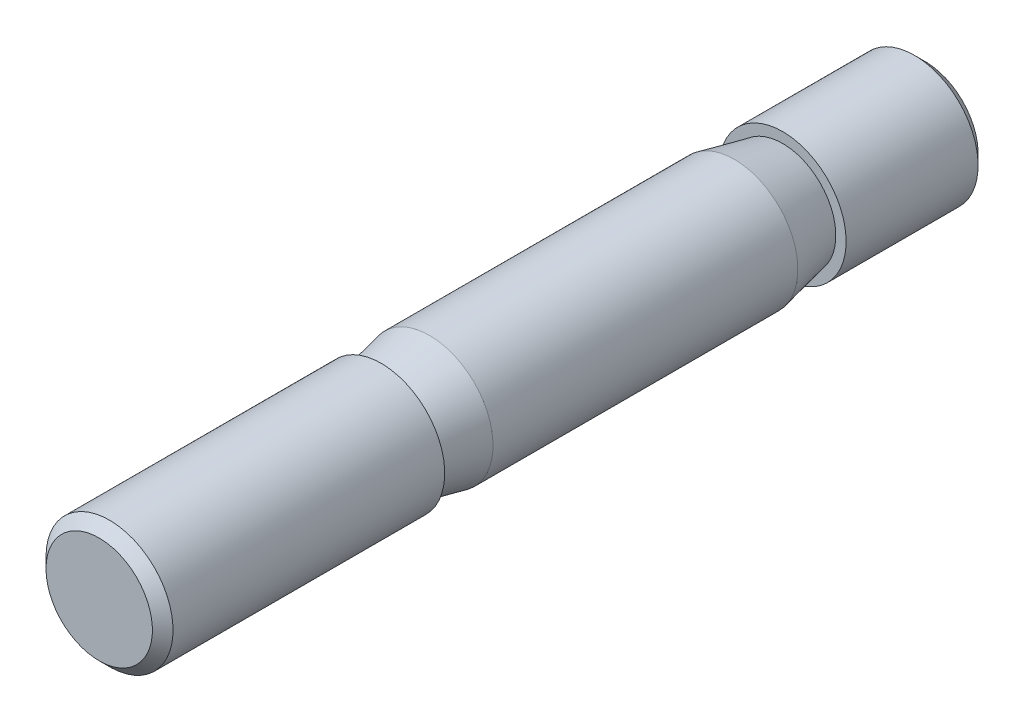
ISO-10303-21;
HEADER;
FILE_DESCRIPTION(('STEP AP214'),'2;1');
FILE_NAME('part.step','',(''),(''),'','','');
FILE_SCHEMA(('AUTOMOTIVE_DESIGN { 1 0 10303 214 1 1 1 1 }'));
ENDSEC;
DATA;
#1=APPLICATION_CONTEXT('core data for automotive mechanical design processes');
#2=APPLICATION_PROTOCOL_DEFINITION('international standard','automotive_design',2000,#1);
#3=PRODUCT_CONTEXT('',#1,'mechanical');
#4=PRODUCT('Part','Part','',(#3));
#5=PRODUCT_RELATED_PRODUCT_CATEGORY('part','',(#4));
#6=PRODUCT_DEFINITION_FORMATION('','',#4);
#7=PRODUCT_DEFINITION_CONTEXT('part definition',#1,'design');
#8=PRODUCT_DEFINITION('design','',#6,#7);
#9=PRODUCT_DEFINITION_SHAPE('','',#8);
#10=(LENGTH_UNIT() NAMED_UNIT(*) SI_UNIT(.MILLI.,.METRE.));
#11=(NAMED_UNIT(*) PLANE_ANGLE_UNIT() SI_UNIT($,.RADIAN.));
#12=(NAMED_UNIT(*) SI_UNIT($,.STERADIAN.) SOLID_ANGLE_UNIT());
#13=UNCERTAINTY_MEASURE_WITH_UNIT(LENGTH_MEASURE(1.E-05),#10,'distance_accuracy_value','');
#14=(GEOMETRIC_REPRESENTATION_CONTEXT(3) GLOBAL_UNCERTAINTY_ASSIGNED_CONTEXT((#13)) GLOBAL_UNIT_ASSIGNED_CONTEXT((#10,
#11,#12)) REPRESENTATION_CONTEXT('',''));
#15=CARTESIAN_POINT('',(0.,0.,0.));
#16=DIRECTION('',(0.,0.,1.));
#17=DIRECTION('',(1.,0.,0.));
#18=AXIS2_PLACEMENT_3D('',#15,#16,#17);
#19=CARTESIAN_POINT('',(0.,0.,50.));
#20=DIRECTION('',(0.,0.,-1.));
#21=DIRECTION('',(-1.,0.,0.));
#22=AXIS2_PLACEMENT_3D('',#19,#20,#21);
#23=PLANE('',#22);
#24=CARTESIAN_POINT('',(0.,0.,50.));
#25=DIRECTION('',(0.,0.,-1.));
#26=DIRECTION('',(-1.,0.,0.));
#27=AXIS2_PLACEMENT_3D('',#24,#25,#26);
#28=CIRCLE('',#27,4.188125);
#29=CARTESIAN_POINT('',(-4.188125,0.,50.));
#30=VERTEX_POINT('',#29);
#31=EDGE_CURVE('E10',#30,#30,#28,.T.);
#32=ORIENTED_EDGE('',*,*,#31,.F.);
#33=EDGE_LOOP('',(#32));
#34=FACE_BOUND('',#33,.T.);
#35=ADVANCED_FACE('F14',(#34),#23,.F.);
#36=CARTESIAN_POINT('',(0.,0.,49.188125));
#37=DIRECTION('',(0.,0.,-1.));
#38=DIRECTION('',(-1.,0.,0.));
#39=AXIS2_PLACEMENT_3D('',#36,#37,#38);
#40=CONICAL_SURFACE('',#39,5.,0.785398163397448);
#41=ORIENTED_EDGE('',*,*,#31,.T.);
#42=EDGE_LOOP('',(#41));
#43=FACE_BOUND('',#42,.T.);
#44=CARTESIAN_POINT('',(0.,0.,49.188125));
#45=DIRECTION('',(0.,0.,-1.));
#46=DIRECTION('',(-1.,0.,0.));
#47=AXIS2_PLACEMENT_3D('',#44,#45,#46);
#48=CIRCLE('',#47,5.);
#49=CARTESIAN_POINT('',(-5.,0.,49.188125));
#50=VERTEX_POINT('',#49);
#51=EDGE_CURVE('E20',#50,#50,#48,.T.);
#52=ORIENTED_EDGE('',*,*,#51,.F.);
#53=EDGE_LOOP('',(#52));
#54=FACE_BOUND('',#53,.T.);
#55=ADVANCED_FACE('F69',(#43,#54),#40,.T.);
#56=CARTESIAN_POINT('',(0.,0.,-15.));
#57=DIRECTION('',(0.,0.,-1.));
#58=DIRECTION('',(-1.,0.,0.));
#59=AXIS2_PLACEMENT_3D('',#56,#57,#58);
#60=CYLINDRICAL_SURFACE('',#59,5.);
#61=CARTESIAN_POINT('',(0.,0.,27.8));
#62=DIRECTION('',(0.,0.,-1.));
#63=DIRECTION('',(-1.,0.,0.));
#64=AXIS2_PLACEMENT_3D('',#61,#62,#63);
#65=CIRCLE('',#64,5.);
#66=CARTESIAN_POINT('',(-5.,0.,27.8));
#67=VERTEX_POINT('',#66);
#68=EDGE_CURVE('E24',#67,#67,#65,.T.);
#69=ORIENTED_EDGE('',*,*,#68,.F.);
#70=EDGE_LOOP('',(#69));
#71=FACE_BOUND('',#70,.T.);
#72=ORIENTED_EDGE('',*,*,#51,.T.);
#73=EDGE_LOOP('',(#72));
#74=FACE_BOUND('',#73,.T.);
#75=ADVANCED_FACE('F74',(#71,#74),#60,.T.);
#76=CARTESIAN_POINT('',(0.,5.,27.8));
#77=DIRECTION('',(0.,0.,1.));
#78=DIRECTION('',(1.,0.,0.));
#79=AXIS2_PLACEMENT_3D('',#76,#77,#78);
#80=PLANE('',#79);
#81=CARTESIAN_POINT('',(0.,0.,27.8));
#82=DIRECTION('',(0.,0.,-1.));
#83=DIRECTION('',(-1.,0.,0.));
#84=AXIS2_PLACEMENT_3D('',#81,#82,#83);
#85=CIRCLE('',#84,4.188125);
#86=CARTESIAN_POINT('',(-4.188125,0.,27.8));
#87=VERTEX_POINT('',#86);
#88=EDGE_CURVE('E28',#87,#87,#85,.T.);
#89=ORIENTED_EDGE('',*,*,#88,.F.);
#90=EDGE_LOOP('',(#89));
#91=FACE_BOUND('',#90,.T.);
#92=ORIENTED_EDGE('',*,*,#68,.T.);
#93=EDGE_LOOP('',(#92));
#94=FACE_BOUND('',#93,.T.);
#95=ADVANCED_FACE('F78',(#91,#94),#80,.F.);
#96=CARTESIAN_POINT('',(0.,0.,27.8));
#97=DIRECTION('',(0.,0.,-1.));
#98=DIRECTION('',(-1.,0.,0.));
#99=AXIS2_PLACEMENT_3D('',#96,#97,#98);
#100=CONICAL_SURFACE('',#99,4.188125,0.210486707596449);
#101=CARTESIAN_POINT('',(0.,0.,24.));
#102=DIRECTION('',(0.,0.,-1.));
#103=DIRECTION('',(-1.,0.,0.));
#104=AXIS2_PLACEMENT_3D('',#101,#102,#103);
#105=CIRCLE('',#104,5.);
#106=CARTESIAN_POINT('',(-5.,0.,24.));
#107=VERTEX_POINT('',#106);
#108=EDGE_CURVE('E33',#107,#107,#105,.T.);
#109=ORIENTED_EDGE('',*,*,#108,.F.);
#110=EDGE_LOOP('',(#109));
#111=FACE_BOUND('',#110,.T.);
#112=ORIENTED_EDGE('',*,*,#88,.T.);
#113=EDGE_LOOP('',(#112));
#114=FACE_BOUND('',#113,.T.);
#115=ADVANCED_FACE('F85',(#111,#114),#100,.T.);
#116=CARTESIAN_POINT('',(0.,0.,-15.));
#117=DIRECTION('',(0.,0.,-1.));
#118=DIRECTION('',(-1.,0.,0.));
#119=AXIS2_PLACEMENT_3D('',#116,#117,#118);
#120=CYLINDRICAL_SURFACE('',#119,5.);
#121=CARTESIAN_POINT('',(0.,0.,0.));
#122=DIRECTION('',(0.,0.,-1.));
#123=DIRECTION('',(-1.,0.,0.));
#124=AXIS2_PLACEMENT_3D('',#121,#122,#123);
#125=CIRCLE('',#124,5.);
#126=CARTESIAN_POINT('',(-5.,0.,0.));
#127=VERTEX_POINT('',#126);
#128=EDGE_CURVE('E36',#127,#127,#125,.T.);
#129=ORIENTED_EDGE('',*,*,#128,.F.);
#130=EDGE_LOOP('',(#129));
#131=FACE_BOUND('',#130,.T.);
#132=ORIENTED_EDGE('',*,*,#108,.T.);
#133=EDGE_LOOP('',(#132));
#134=FACE_BOUND('',#133,.T.);
#135=ADVANCED_FACE('F89',(#131,#134),#120,.T.);
#136=CARTESIAN_POINT('',(0.,0.,-3.8));
#137=DIRECTION('',(0.,0.,1.));
#138=DIRECTION('',(1.,0.,0.));
#139=AXIS2_PLACEMENT_3D('',#136,#137,#138);
#140=CONICAL_SURFACE('',#139,4.188125,0.210486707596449);
#141=ORIENTED_EDGE('',*,*,#128,.T.);
#142=EDGE_LOOP('',(#141));
#143=FACE_BOUND('',#142,.T.);
#144=CARTESIAN_POINT('',(0.,0.,-3.8));
#145=DIRECTION('',(0.,0.,-1.));
#146=DIRECTION('',(-1.,0.,0.));
#147=AXIS2_PLACEMENT_3D('',#144,#145,#146);
#148=CIRCLE('',#147,4.188125);
#149=CARTESIAN_POINT('',(-4.188125,0.,-3.8));
#150=VERTEX_POINT('',#149);
#151=EDGE_CURVE('E39',#150,#150,#148,.T.);
#152=ORIENTED_EDGE('',*,*,#151,.F.);
#153=EDGE_LOOP('',(#152));
#154=FACE_BOUND('',#153,.T.);
#155=ADVANCED_FACE('F93',(#143,#154),#140,.T.);
#156=CARTESIAN_POINT('',(0.,5.,-3.8));
#157=DIRECTION('',(0.,0.,1.));
#158=DIRECTION('',(1.,0.,0.));
#159=AXIS2_PLACEMENT_3D('',#156,#157,#158);
#160=PLANE('',#159);
#161=ORIENTED_EDGE('',*,*,#151,.T.);
#162=EDGE_LOOP('',(#161));
#163=FACE_BOUND('',#162,.T.);
#164=CARTESIAN_POINT('',(0.,0.,-3.8));
#165=DIRECTION('',(0.,0.,-1.));
#166=DIRECTION('',(-1.,0.,0.));
#167=AXIS2_PLACEMENT_3D('',#164,#165,#166);
#168=CIRCLE('',#167,5.);
#169=CARTESIAN_POINT('',(-5.,0.,-3.8));
#170=VERTEX_POINT('',#169);
#171=EDGE_CURVE('E42',#170,#170,#168,.T.);
#172=ORIENTED_EDGE('',*,*,#171,.F.);
#173=EDGE_LOOP('',(#172));
#174=FACE_BOUND('',#173,.T.);
#175=ADVANCED_FACE('F65',(#163,#174),#160,.T.);
#176=CARTESIAN_POINT('',(0.,0.,-15.));
#177=DIRECTION('',(0.,0.,-1.));
#178=DIRECTION('',(-1.,0.,0.));
#179=AXIS2_PLACEMENT_3D('',#176,#177,#178);
#180=CYLINDRICAL_SURFACE('',#179,5.);
#181=CARTESIAN_POINT('',(0.,0.,-14.188125));
#182=DIRECTION('',(0.,0.,-1.));
#183=DIRECTION('',(-1.,0.,0.));
#184=AXIS2_PLACEMENT_3D('',#181,#182,#183);
#185=CIRCLE('',#184,5.);
#186=CARTESIAN_POINT('',(-5.,0.,-14.188125));
#187=VERTEX_POINT('',#186);
#188=EDGE_CURVE('E45',#187,#187,#185,.T.);
#189=ORIENTED_EDGE('',*,*,#188,.F.);
#190=EDGE_LOOP('',(#189));
#191=FACE_BOUND('',#190,.T.);
#192=ORIENTED_EDGE('',*,*,#171,.T.);
#193=EDGE_LOOP('',(#192));
#194=FACE_BOUND('',#193,.T.);
#195=ADVANCED_FACE('F56',(#191,#194),#180,.T.);
#196=CARTESIAN_POINT('',(0.,0.,-15.));
#197=DIRECTION('',(0.,0.,1.));
#198=DIRECTION('',(1.,0.,0.));
#199=AXIS2_PLACEMENT_3D('',#196,#197,#198);
#200=CONICAL_SURFACE('',#199,4.188125,0.785398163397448);
#201=ORIENTED_EDGE('',*,*,#188,.T.);
#202=EDGE_LOOP('',(#201));
#203=FACE_BOUND('',#202,.T.);
#204=CARTESIAN_POINT('',(0.,0.,-15.));
#205=DIRECTION('',(0.,0.,-1.));
#206=DIRECTION('',(-1.,0.,0.));
#207=AXIS2_PLACEMENT_3D('',#204,#205,#206);
#208=CIRCLE('',#207,4.188125);
#209=CARTESIAN_POINT('',(-4.188125,0.,-15.));
#210=VERTEX_POINT('',#209);
#211=EDGE_CURVE('E48',#210,#210,#208,.T.);
#212=ORIENTED_EDGE('',*,*,#211,.F.);
#213=EDGE_LOOP('',(#212));
#214=FACE_BOUND('',#213,.T.);
#215=ADVANCED_FACE('F54',(#203,#214),#200,.T.);
#216=CARTESIAN_POINT('',(0.,4.188125,-15.));
#217=DIRECTION('',(0.,0.,1.));
#218=DIRECTION('',(1.,0.,0.));
#219=AXIS2_PLACEMENT_3D('',#216,#217,#218);
#220=PLANE('',#219);
#221=ORIENTED_EDGE('',*,*,#211,.T.);
#222=EDGE_LOOP('',(#221));
#223=FACE_BOUND('',#222,.T.);
#224=ADVANCED_FACE('F52',(#223),#220,.F.);
#225=CLOSED_SHELL('',(#35,#55,#75,#95,#115,#135,#155,#175,#195,#215,#224));
#226=MANIFOLD_SOLID_BREP('B1',#225);
#227=ADVANCED_BREP_SHAPE_REPRESENTATION('',(#18,#226),#14);
#228=SHAPE_DEFINITION_REPRESENTATION(#9,#227);
ENDSEC;
END-ISO-10303-21;
